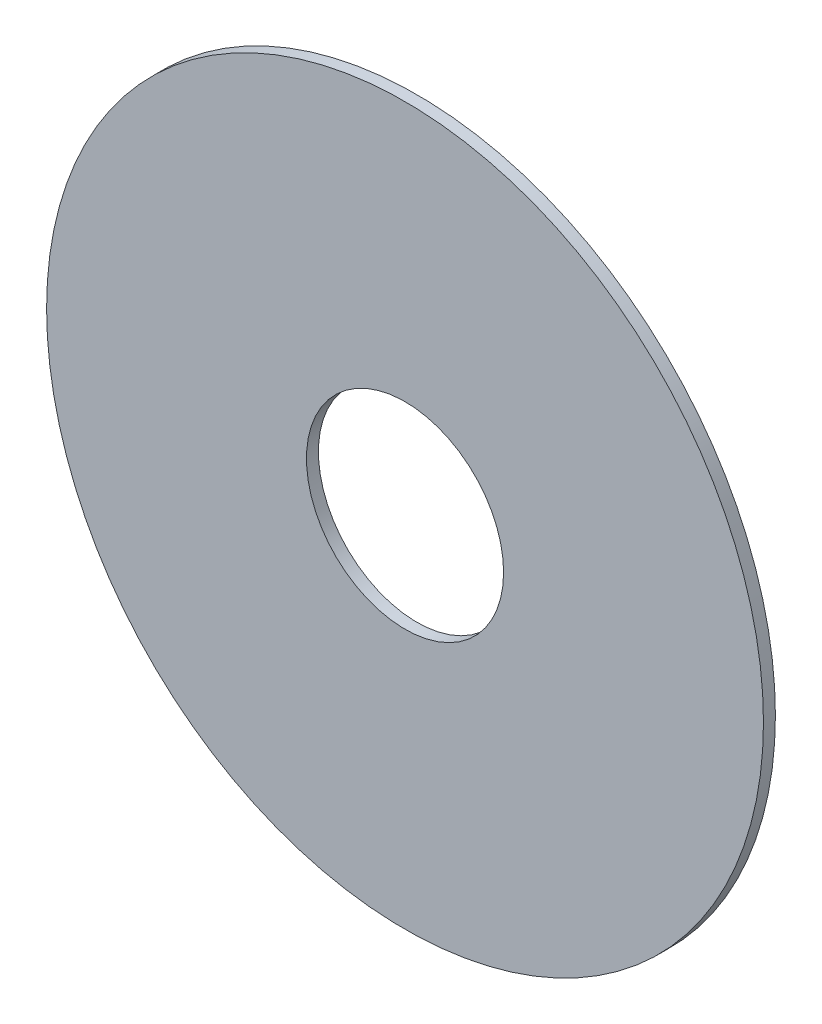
from build123d import *

# Parameters (mm, degrees)
ESQUISSE1_R          = 30
ESQUISSE1_R_2        = 8.25
BASE_EXTRUSION_DEPTH = 1


with BuildPart() as part:
    # Esquisse1 → Base-Extrusion (new body)
    with BuildSketch(Plane.XY):
        Circle(ESQUISSE1_R)
        Circle(ESQUISSE1_R_2, mode=Mode.SUBTRACT)
    extrude(amount=BASE_EXTRUSION_DEPTH)


solid = part.part
